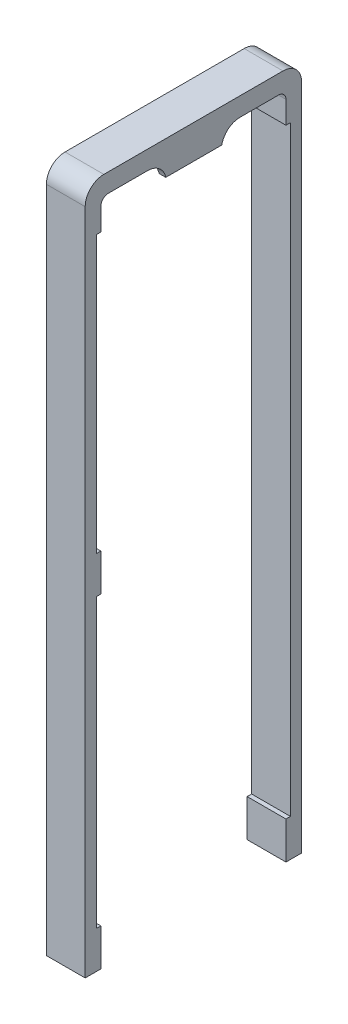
ISO-10303-21;
HEADER;
FILE_DESCRIPTION(('STEP AP214'),'2;1');
FILE_NAME('part.step','',(''),(''),'','','');
FILE_SCHEMA(('AUTOMOTIVE_DESIGN { 1 0 10303 214 1 1 1 1 }'));
ENDSEC;
DATA;
#1=APPLICATION_CONTEXT('core data for automotive mechanical design processes');
#2=APPLICATION_PROTOCOL_DEFINITION('international standard','automotive_design',2000,#1);
#3=PRODUCT_CONTEXT('',#1,'mechanical');
#4=PRODUCT('Part','Part','',(#3));
#5=PRODUCT_RELATED_PRODUCT_CATEGORY('part','',(#4));
#6=PRODUCT_DEFINITION_FORMATION('','',#4);
#7=PRODUCT_DEFINITION_CONTEXT('part definition',#1,'design');
#8=PRODUCT_DEFINITION('design','',#6,#7);
#9=PRODUCT_DEFINITION_SHAPE('','',#8);
#10=(LENGTH_UNIT() NAMED_UNIT(*) SI_UNIT(.MILLI.,.METRE.));
#11=(NAMED_UNIT(*) PLANE_ANGLE_UNIT() SI_UNIT($,.RADIAN.));
#12=(NAMED_UNIT(*) SI_UNIT($,.STERADIAN.) SOLID_ANGLE_UNIT());
#13=UNCERTAINTY_MEASURE_WITH_UNIT(LENGTH_MEASURE(1.E-05),#10,'distance_accuracy_value','');
#14=(GEOMETRIC_REPRESENTATION_CONTEXT(3) GLOBAL_UNCERTAINTY_ASSIGNED_CONTEXT((#13)) GLOBAL_UNIT_ASSIGNED_CONTEXT((#10,
#11,#12)) REPRESENTATION_CONTEXT('',''));
#15=CARTESIAN_POINT('',(0.,0.,0.));
#16=DIRECTION('',(0.,0.,1.));
#17=DIRECTION('',(1.,0.,0.));
#18=AXIS2_PLACEMENT_3D('',#15,#16,#17);
#19=CARTESIAN_POINT('',(0.,0.,4.2));
#20=DIRECTION('',(0.,0.,1.));
#21=DIRECTION('',(1.,0.,0.));
#22=AXIS2_PLACEMENT_3D('',#19,#20,#21);
#23=PLANE('',#22);
#24=DIRECTION('',(1.,0.,0.));
#25=VECTOR('',#24,1.);
#26=CARTESIAN_POINT('',(0.,-92.2973780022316,4.2));
#27=LINE('',#26,#25);
#28=CARTESIAN_POINT('',(-39.6440788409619,-92.2973780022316,4.20000000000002));
#29=VERTEX_POINT('',#28);
#30=CARTESIAN_POINT('',(-29.2440788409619,-92.2973780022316,4.20000000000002));
#31=VERTEX_POINT('',#30);
#32=EDGE_CURVE('E262',#29,#31,#27,.T.);
#33=ORIENTED_EDGE('',*,*,#32,.F.);
#34=DIRECTION('',(0.,-1.,0.));
#35=VECTOR('',#34,1.);
#36=CARTESIAN_POINT('',(-39.6440788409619,81.7026219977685,4.2));
#37=LINE('',#36,#35);
#38=CARTESIAN_POINT('',(-39.6440788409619,-102.297378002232,4.2));
#39=VERTEX_POINT('',#38);
#40=EDGE_CURVE('E281',#29,#39,#37,.T.);
#41=ORIENTED_EDGE('',*,*,#40,.T.);
#42=DIRECTION('',(1.,0.,0.));
#43=VECTOR('',#42,1.);
#44=CARTESIAN_POINT('',(-39.6440788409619,-102.297378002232,4.2));
#45=LINE('',#44,#43);
#46=CARTESIAN_POINT('',(-29.2440788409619,-102.297378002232,4.2));
#47=VERTEX_POINT('',#46);
#48=EDGE_CURVE('E280',#39,#47,#45,.T.);
#49=ORIENTED_EDGE('',*,*,#48,.T.);
#50=DIRECTION('',(0.,1.,0.));
#51=VECTOR('',#50,1.);
#52=CARTESIAN_POINT('',(-29.2440788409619,81.7026219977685,4.2));
#53=LINE('',#52,#51);
#54=EDGE_CURVE('E290',#47,#31,#53,.T.);
#55=ORIENTED_EDGE('',*,*,#54,.T.);
#56=EDGE_LOOP('',(#33,#41,#49,#55));
#57=FACE_BOUND('',#56,.T.);
#58=ADVANCED_FACE('F33',(#57),#23,.T.);
#59=CARTESIAN_POINT('',(0.,0.,53.8));
#60=DIRECTION('',(0.,0.,1.));
#61=DIRECTION('',(1.,0.,0.));
#62=AXIS2_PLACEMENT_3D('',#59,#60,#61);
#63=PLANE('',#62);
#64=DIRECTION('',(0.,1.,0.));
#65=VECTOR('',#64,1.);
#66=CARTESIAN_POINT('',(-29.2440788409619,81.7026219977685,53.8));
#67=LINE('',#66,#65);
#68=CARTESIAN_POINT('',(-29.2440788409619,-15.2973780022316,53.8));
#69=VERTEX_POINT('',#68);
#70=CARTESIAN_POINT('',(-29.2440788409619,-5.29737800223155,53.8));
#71=VERTEX_POINT('',#70);
#72=EDGE_CURVE('E523',#69,#71,#67,.T.);
#73=ORIENTED_EDGE('',*,*,#72,.F.);
#74=DIRECTION('',(-1.,0.,0.));
#75=VECTOR('',#74,1.);
#76=CARTESIAN_POINT('',(0.,-15.2973780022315,53.8));
#77=LINE('',#76,#75);
#78=CARTESIAN_POINT('',(-39.6440788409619,-15.2973780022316,53.8));
#79=VERTEX_POINT('',#78);
#80=EDGE_CURVE('E263',#69,#79,#77,.T.);
#81=ORIENTED_EDGE('',*,*,#80,.T.);
#82=DIRECTION('',(0.,-1.,0.));
#83=VECTOR('',#82,1.);
#84=CARTESIAN_POINT('',(-39.6440788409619,81.7026219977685,53.8));
#85=LINE('',#84,#83);
#86=CARTESIAN_POINT('',(-39.6440788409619,-5.29737800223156,53.8));
#87=VERTEX_POINT('',#86);
#88=EDGE_CURVE('E519',#87,#79,#85,.T.);
#89=ORIENTED_EDGE('',*,*,#88,.F.);
#90=DIRECTION('',(1.,0.,0.));
#91=VECTOR('',#90,1.);
#92=CARTESIAN_POINT('',(0.,-5.29737800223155,53.8));
#93=LINE('',#92,#91);
#94=EDGE_CURVE('E422',#87,#71,#93,.T.);
#95=ORIENTED_EDGE('',*,*,#94,.T.);
#96=EDGE_LOOP('',(#73,#81,#89,#95));
#97=FACE_BOUND('',#96,.T.);
#98=ADVANCED_FACE('F592',(#97),#63,.F.);
#99=CARTESIAN_POINT('',(-29.2440788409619,68.7026219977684,53.8));
#100=VERTEX_POINT('',#99);
#101=CARTESIAN_POINT('',(-29.2440788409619,74.7026219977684,53.8));
#102=VERTEX_POINT('',#101);
#103=EDGE_CURVE('E521',#100,#102,#67,.T.);
#104=ORIENTED_EDGE('',*,*,#103,.F.);
#105=DIRECTION('',(-1.,0.,0.));
#106=VECTOR('',#105,1.);
#107=CARTESIAN_POINT('',(0.,68.7026219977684,53.8));
#108=LINE('',#107,#106);
#109=CARTESIAN_POINT('',(-39.6440788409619,68.7026219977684,53.8));
#110=VERTEX_POINT('',#109);
#111=EDGE_CURVE('E425',#100,#110,#108,.T.);
#112=ORIENTED_EDGE('',*,*,#111,.T.);
#113=CARTESIAN_POINT('',(-39.6440788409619,74.7026219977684,53.8));
#114=VERTEX_POINT('',#113);
#115=EDGE_CURVE('E515',#114,#110,#85,.T.);
#116=ORIENTED_EDGE('',*,*,#115,.F.);
#117=DIRECTION('',(1.,0.,0.));
#118=VECTOR('',#117,1.);
#119=CARTESIAN_POINT('',(-29.2440788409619,74.7026219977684,53.8));
#120=LINE('',#119,#118);
#121=EDGE_CURVE('E315',#114,#102,#120,.T.);
#122=ORIENTED_EDGE('',*,*,#121,.T.);
#123=EDGE_LOOP('',(#104,#112,#116,#122));
#124=FACE_BOUND('',#123,.T.);
#125=ADVANCED_FACE('F585',(#124),#63,.F.);
#126=CARTESIAN_POINT('',(0.,74.7026219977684,0.));
#127=DIRECTION('',(0.,1.,0.));
#128=DIRECTION('',(0.,0.,1.));
#129=AXIS2_PLACEMENT_3D('',#126,#127,#128);
#130=PLANE('',#129);
#131=DIRECTION('',(-1.,0.,0.));
#132=VECTOR('',#131,1.);
#133=CARTESIAN_POINT('',(-31.0440788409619,74.7026219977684,37.2989794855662));
#134=LINE('',#133,#132);
#135=CARTESIAN_POINT('',(-31.2440788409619,74.7026219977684,37.2989794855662));
#136=VERTEX_POINT('',#135);
#137=CARTESIAN_POINT('',(-37.6440788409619,74.7026219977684,37.2989794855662));
#138=VERTEX_POINT('',#137);
#139=EDGE_CURVE('E348',#136,#138,#134,.T.);
#140=ORIENTED_EDGE('',*,*,#139,.T.);
#141=DIRECTION('',(0.,0.,1.));
#142=VECTOR('',#141,1.);
#143=CARTESIAN_POINT('',(-37.6440788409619,74.7026219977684,20.5010205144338));
#144=LINE('',#143,#142);
#145=CARTESIAN_POINT('',(-37.6440788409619,74.7026219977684,20.5010205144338));
#146=VERTEX_POINT('',#145);
#147=EDGE_CURVE('E362',#138,#146,#144,.F.);
#148=ORIENTED_EDGE('',*,*,#147,.T.);
#149=DIRECTION('',(-1.,0.,0.));
#150=VECTOR('',#149,1.);
#151=CARTESIAN_POINT('',(-37.8440788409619,74.7026219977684,20.5010205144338));
#152=LINE('',#151,#150);
#153=CARTESIAN_POINT('',(-31.2440788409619,74.7026219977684,20.5010205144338));
#154=VERTEX_POINT('',#153);
#155=EDGE_CURVE('E336',#146,#154,#152,.F.);
#156=ORIENTED_EDGE('',*,*,#155,.T.);
#157=DIRECTION('',(0.,0.,-1.));
#158=VECTOR('',#157,1.);
#159=CARTESIAN_POINT('',(-31.2440788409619,74.7026219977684,37.2989794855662));
#160=LINE('',#159,#158);
#161=EDGE_CURVE('E360',#154,#136,#160,.F.);
#162=ORIENTED_EDGE('',*,*,#161,.T.);
#163=EDGE_LOOP('',(#140,#148,#156,#162));
#164=FACE_BOUND('',#163,.T.);
#165=ADVANCED_FACE('F583',(#164),#130,.F.);
#166=CARTESIAN_POINT('',(-39.6440788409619,76.7026219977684,53.8));
#167=DIRECTION('',(0.,1.,0.));
#168=DIRECTION('',(0.,0.,1.));
#169=AXIS2_PLACEMENT_3D('',#166,#167,#168);
#170=PLANE('',#169);
#171=DIRECTION('',(0.,0.,-1.));
#172=VECTOR('',#171,1.);
#173=CARTESIAN_POINT('',(-29.2440788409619,76.7026219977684,53.8));
#174=LINE('',#173,#172);
#175=CARTESIAN_POINT('',(-29.2440788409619,76.7026219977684,16.5010205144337));
#176=VERTEX_POINT('',#175);
#177=CARTESIAN_POINT('',(-29.2440788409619,76.7026219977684,6.20000000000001));
#178=VERTEX_POINT('',#177);
#179=EDGE_CURVE('E528',#176,#178,#174,.T.);
#180=ORIENTED_EDGE('',*,*,#179,.F.);
#181=DIRECTION('',(-1.,0.,0.));
#182=VECTOR('',#181,1.);
#183=CARTESIAN_POINT('',(-39.6440788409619,76.7026219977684,16.5010205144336));
#184=LINE('',#183,#182);
#185=CARTESIAN_POINT('',(-39.6440788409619,76.7026219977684,16.5010205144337));
#186=VERTEX_POINT('',#185);
#187=EDGE_CURVE('E329',#176,#186,#184,.T.);
#188=ORIENTED_EDGE('',*,*,#187,.T.);
#189=DIRECTION('',(0.,0.,-1.));
#190=VECTOR('',#189,1.);
#191=CARTESIAN_POINT('',(-39.6440788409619,76.7026219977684,53.8));
#192=LINE('',#191,#190);
#193=CARTESIAN_POINT('',(-39.6440788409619,76.7026219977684,6.20000000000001));
#194=VERTEX_POINT('',#193);
#195=EDGE_CURVE('E531',#186,#194,#192,.T.);
#196=ORIENTED_EDGE('',*,*,#195,.T.);
#197=DIRECTION('',(1.,0.,0.));
#198=VECTOR('',#197,1.);
#199=CARTESIAN_POINT('',(-39.6440788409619,76.7026219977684,6.2));
#200=LINE('',#199,#198);
#201=EDGE_CURVE('E311',#194,#178,#200,.T.);
#202=ORIENTED_EDGE('',*,*,#201,.T.);
#203=EDGE_LOOP('',(#180,#188,#196,#202));
#204=FACE_BOUND('',#203,.T.);
#205=ADVANCED_FACE('F543',(#204),#170,.F.);
#206=CARTESIAN_POINT('',(-39.6440788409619,76.7026219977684,51.8));
#207=VERTEX_POINT('',#206);
#208=CARTESIAN_POINT('',(-39.6440788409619,76.7026219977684,41.2989794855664));
#209=VERTEX_POINT('',#208);
#210=EDGE_CURVE('E287',#207,#209,#192,.T.);
#211=ORIENTED_EDGE('',*,*,#210,.T.);
#212=DIRECTION('',(-1.,0.,0.));
#213=VECTOR('',#212,1.);
#214=CARTESIAN_POINT('',(-39.6440788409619,76.7026219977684,41.2989794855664));
#215=LINE('',#214,#213);
#216=CARTESIAN_POINT('',(-29.2440788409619,76.7026219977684,41.2989794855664));
#217=VERTEX_POINT('',#216);
#218=EDGE_CURVE('E331',#209,#217,#215,.F.);
#219=ORIENTED_EDGE('',*,*,#218,.T.);
#220=CARTESIAN_POINT('',(-29.2440788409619,76.7026219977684,51.8));
#221=VERTEX_POINT('',#220);
#222=EDGE_CURVE('E529',#221,#217,#174,.T.);
#223=ORIENTED_EDGE('',*,*,#222,.F.);
#224=DIRECTION('',(1.,0.,0.));
#225=VECTOR('',#224,1.);
#226=CARTESIAN_POINT('',(-39.6440788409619,76.7026219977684,51.8));
#227=LINE('',#226,#225);
#228=EDGE_CURVE('E318',#221,#207,#227,.F.);
#229=ORIENTED_EDGE('',*,*,#228,.T.);
#230=EDGE_LOOP('',(#211,#219,#223,#229));
#231=FACE_BOUND('',#230,.T.);
#232=ADVANCED_FACE('F566',(#231),#170,.F.);
#233=CARTESIAN_POINT('',(-39.6440788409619,81.7026219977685,4.2));
#234=DIRECTION('',(1.,0.,0.));
#235=DIRECTION('',(0.,1.,0.));
#236=AXIS2_PLACEMENT_3D('',#233,#234,#235);
#237=PLANE('',#236);
#238=ORIENTED_EDGE('',*,*,#40,.F.);
#239=DIRECTION('',(0.,0.,1.));
#240=VECTOR('',#239,1.);
#241=CARTESIAN_POINT('',(-39.6440788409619,-92.2973780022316,4.20000000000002));
#242=LINE('',#241,#240);
#243=CARTESIAN_POINT('',(-39.6440788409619,-92.2973780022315,3.00000000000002));
#244=VERTEX_POINT('',#243);
#245=EDGE_CURVE('E931',#244,#29,#242,.T.);
#246=ORIENTED_EDGE('',*,*,#245,.F.);
#247=DIRECTION('',(0.,-1.,0.));
#248=VECTOR('',#247,1.);
#249=CARTESIAN_POINT('',(-39.6440788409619,68.7026219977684,3.));
#250=LINE('',#249,#248);
#251=CARTESIAN_POINT('',(-39.6440788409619,68.7026219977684,3.));
#252=VERTEX_POINT('',#251);
#253=EDGE_CURVE('E274',#252,#244,#250,.T.);
#254=ORIENTED_EDGE('',*,*,#253,.F.);
#255=DIRECTION('',(0.,0.,-1.));
#256=VECTOR('',#255,1.);
#257=CARTESIAN_POINT('',(-39.6440788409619,68.7026219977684,4.2));
#258=LINE('',#257,#256);
#259=CARTESIAN_POINT('',(-39.6440788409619,68.7026219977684,4.2));
#260=VERTEX_POINT('',#259);
#261=EDGE_CURVE('E257',#260,#252,#258,.T.);
#262=ORIENTED_EDGE('',*,*,#261,.F.);
#263=CARTESIAN_POINT('',(-39.6440788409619,74.7026219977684,4.2));
#264=VERTEX_POINT('',#263);
#265=EDGE_CURVE('E270',#264,#260,#37,.T.);
#266=ORIENTED_EDGE('',*,*,#265,.F.);
#267=CARTESIAN_POINT('',(-39.6440788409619,74.7026219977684,6.2));
#268=DIRECTION('',(1.,0.,0.));
#269=DIRECTION('',(0.,1.,0.));
#270=AXIS2_PLACEMENT_3D('',#267,#268,#269);
#271=CIRCLE('',#270,2.);
#272=EDGE_CURVE('E323',#264,#194,#271,.T.);
#273=ORIENTED_EDGE('',*,*,#272,.T.);
#274=ORIENTED_EDGE('',*,*,#195,.F.);
#275=CARTESIAN_POINT('',(-39.6440788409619,71.7026219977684,16.5010205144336));
#276=DIRECTION('',(1.,0.,0.));
#277=DIRECTION('',(0.,1.,0.));
#278=AXIS2_PLACEMENT_3D('',#275,#276,#277);
#279=CIRCLE('',#278,5.);
#280=CARTESIAN_POINT('',(-39.6440788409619,72.7026219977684,21.4));
#281=VERTEX_POINT('',#280);
#282=EDGE_CURVE('E343',#186,#281,#279,.T.);
#283=ORIENTED_EDGE('',*,*,#282,.T.);
#284=DIRECTION('',(0.,0.,-1.));
#285=VECTOR('',#284,1.);
#286=CARTESIAN_POINT('',(-39.6440788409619,72.7026219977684,21.4));
#287=LINE('',#286,#285);
#288=CARTESIAN_POINT('',(-39.6440788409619,72.7026219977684,36.4));
#289=VERTEX_POINT('',#288);
#290=EDGE_CURVE('E494',#289,#281,#287,.T.);
#291=ORIENTED_EDGE('',*,*,#290,.F.);
#292=CARTESIAN_POINT('',(-39.6440788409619,71.7026219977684,41.2989794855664));
#293=DIRECTION('',(1.,0.,0.));
#294=DIRECTION('',(0.,1.,0.));
#295=AXIS2_PLACEMENT_3D('',#292,#293,#294);
#296=CIRCLE('',#295,5.);
#297=EDGE_CURVE('E353',#289,#209,#296,.T.);
#298=ORIENTED_EDGE('',*,*,#297,.T.);
#299=ORIENTED_EDGE('',*,*,#210,.F.);
#300=CARTESIAN_POINT('',(-39.6440788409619,74.7026219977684,51.8));
#301=DIRECTION('',(1.,0.,0.));
#302=DIRECTION('',(0.,1.,0.));
#303=AXIS2_PLACEMENT_3D('',#300,#301,#302);
#304=CIRCLE('',#303,2.);
#305=EDGE_CURVE('E327',#207,#114,#304,.T.);
#306=ORIENTED_EDGE('',*,*,#305,.T.);
#307=ORIENTED_EDGE('',*,*,#115,.T.);
#308=DIRECTION('',(0.,0.,-1.));
#309=VECTOR('',#308,1.);
#310=CARTESIAN_POINT('',(-39.6440788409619,68.7026219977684,53.8));
#311=LINE('',#310,#309);
#312=CARTESIAN_POINT('',(-39.6440788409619,68.7026219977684,55.));
#313=VERTEX_POINT('',#312);
#314=EDGE_CURVE('E471',#313,#110,#311,.T.);
#315=ORIENTED_EDGE('',*,*,#314,.F.);
#316=DIRECTION('',(0.,1.,0.));
#317=VECTOR('',#316,1.);
#318=CARTESIAN_POINT('',(-39.6440788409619,68.7026219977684,55.));
#319=LINE('',#318,#317);
#320=CARTESIAN_POINT('',(-39.6440788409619,-5.29737800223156,55.));
#321=VERTEX_POINT('',#320);
#322=EDGE_CURVE('E468',#321,#313,#319,.T.);
#323=ORIENTED_EDGE('',*,*,#322,.F.);
#324=DIRECTION('',(0.,0.,1.));
#325=VECTOR('',#324,1.);
#326=CARTESIAN_POINT('',(-39.6440788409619,-5.29737800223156,53.8));
#327=LINE('',#326,#325);
#328=EDGE_CURVE('E465',#87,#321,#327,.T.);
#329=ORIENTED_EDGE('',*,*,#328,.F.);
#330=ORIENTED_EDGE('',*,*,#88,.T.);
#331=DIRECTION('',(0.,0.,-1.));
#332=VECTOR('',#331,1.);
#333=CARTESIAN_POINT('',(-39.6440788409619,-15.2973780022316,53.8));
#334=LINE('',#333,#332);
#335=CARTESIAN_POINT('',(-39.6440788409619,-15.2973780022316,55.));
#336=VERTEX_POINT('',#335);
#337=EDGE_CURVE('E452',#336,#79,#334,.T.);
#338=ORIENTED_EDGE('',*,*,#337,.F.);
#339=DIRECTION('',(0.,1.,0.));
#340=VECTOR('',#339,1.);
#341=CARTESIAN_POINT('',(-39.6440788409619,-15.2973780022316,55.));
#342=LINE('',#341,#340);
#343=CARTESIAN_POINT('',(-39.6440788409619,-92.2973780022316,55.));
#344=VERTEX_POINT('',#343);
#345=EDGE_CURVE('E455',#344,#336,#342,.T.);
#346=ORIENTED_EDGE('',*,*,#345,.F.);
#347=DIRECTION('',(0.,0.,1.));
#348=VECTOR('',#347,1.);
#349=CARTESIAN_POINT('',(-39.6440788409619,-92.2973780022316,53.8));
#350=LINE('',#349,#348);
#351=CARTESIAN_POINT('',(-39.6440788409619,-92.2973780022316,53.8));
#352=VERTEX_POINT('',#351);
#353=EDGE_CURVE('E450',#352,#344,#350,.T.);
#354=ORIENTED_EDGE('',*,*,#353,.F.);
#355=CARTESIAN_POINT('',(-39.6440788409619,-102.297378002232,53.8));
#356=VERTEX_POINT('',#355);
#357=EDGE_CURVE('E505',#352,#356,#85,.T.);
#358=ORIENTED_EDGE('',*,*,#357,.T.);
#359=DIRECTION('',(0.,0.,-1.));
#360=VECTOR('',#359,1.);
#361=CARTESIAN_POINT('',(-39.6440788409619,-102.297378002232,58.));
#362=LINE('',#361,#360);
#363=CARTESIAN_POINT('',(-39.6440788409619,-102.297378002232,58.));
#364=VERTEX_POINT('',#363);
#365=EDGE_CURVE('E526',#364,#356,#362,.T.);
#366=ORIENTED_EDGE('',*,*,#365,.F.);
#367=DIRECTION('',(0.,-1.,0.));
#368=VECTOR('',#367,1.);
#369=CARTESIAN_POINT('',(-39.6440788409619,81.7026219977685,58.));
#370=LINE('',#369,#368);
#371=CARTESIAN_POINT('',(-39.6440788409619,76.7026219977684,58.));
#372=VERTEX_POINT('',#371);
#373=EDGE_CURVE('E506',#372,#364,#370,.T.);
#374=ORIENTED_EDGE('',*,*,#373,.F.);
#375=CARTESIAN_POINT('',(-39.6440788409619,76.7026219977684,53.));
#376=DIRECTION('',(1.,0.,0.));
#377=DIRECTION('',(0.,1.,0.));
#378=AXIS2_PLACEMENT_3D('',#375,#376,#377);
#379=CIRCLE('',#378,5.);
#380=CARTESIAN_POINT('',(-39.6440788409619,81.7026219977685,53.));
#381=VERTEX_POINT('',#380);
#382=EDGE_CURVE('E409',#372,#381,#379,.F.);
#383=ORIENTED_EDGE('',*,*,#382,.T.);
#384=DIRECTION('',(0.,0.,-1.));
#385=VECTOR('',#384,1.);
#386=CARTESIAN_POINT('',(-39.6440788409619,81.7026219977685,4.2));
#387=LINE('',#386,#385);
#388=CARTESIAN_POINT('',(-39.6440788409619,81.7026219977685,5.));
#389=VERTEX_POINT('',#388);
#390=EDGE_CURVE('E293',#381,#389,#387,.T.);
#391=ORIENTED_EDGE('',*,*,#390,.T.);
#392=CARTESIAN_POINT('',(-39.6440788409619,76.7026219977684,5.));
#393=DIRECTION('',(1.,0.,0.));
#394=DIRECTION('',(0.,1.,0.));
#395=AXIS2_PLACEMENT_3D('',#392,#393,#394);
#396=CIRCLE('',#395,5.);
#397=CARTESIAN_POINT('',(-39.6440788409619,76.7026219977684,0.));
#398=VERTEX_POINT('',#397);
#399=EDGE_CURVE('E411',#389,#398,#396,.F.);
#400=ORIENTED_EDGE('',*,*,#399,.T.);
#401=DIRECTION('',(0.,-1.,0.));
#402=VECTOR('',#401,1.);
#403=CARTESIAN_POINT('',(-39.6440788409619,81.7026219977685,0.));
#404=LINE('',#403,#402);
#405=CARTESIAN_POINT('',(-39.6440788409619,-102.297378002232,0.));
#406=VERTEX_POINT('',#405);
#407=EDGE_CURVE('E294',#398,#406,#404,.T.);
#408=ORIENTED_EDGE('',*,*,#407,.T.);
#409=DIRECTION('',(0.,0.,-1.));
#410=VECTOR('',#409,1.);
#411=CARTESIAN_POINT('',(-39.6440788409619,-102.297378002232,4.2));
#412=LINE('',#411,#410);
#413=EDGE_CURVE('E308',#39,#406,#412,.T.);
#414=ORIENTED_EDGE('',*,*,#413,.F.);
#415=EDGE_LOOP('',(#238,#246,#254,#262,#266,#273,#274,#283,#291,#298,#299,#306,#307,#315,#323,
#329,#330,#338,#346,#354,#358,#366,#374,#383,#391,#400,#408,#414));
#416=FACE_BOUND('',#415,.T.);
#417=ADVANCED_FACE('F268',(#416),#237,.F.);
#418=CARTESIAN_POINT('',(-39.6440788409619,-102.297378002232,4.2));
#419=DIRECTION('',(0.,1.,0.));
#420=DIRECTION('',(0.,0.,1.));
#421=AXIS2_PLACEMENT_3D('',#418,#419,#420);
#422=PLANE('',#421);
#423=DIRECTION('',(1.,0.,0.));
#424=VECTOR('',#423,1.);
#425=CARTESIAN_POINT('',(-39.6440788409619,-102.297378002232,0.));
#426=LINE('',#425,#424);
#427=CARTESIAN_POINT('',(-29.2440788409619,-102.297378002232,0.));
#428=VERTEX_POINT('',#427);
#429=EDGE_CURVE('E296',#406,#428,#426,.T.);
#430=ORIENTED_EDGE('',*,*,#429,.T.);
#431=DIRECTION('',(0.,0.,-1.));
#432=VECTOR('',#431,1.);
#433=CARTESIAN_POINT('',(-29.2440788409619,-102.297378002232,4.2));
#434=LINE('',#433,#432);
#435=EDGE_CURVE('E305',#47,#428,#434,.T.);
#436=ORIENTED_EDGE('',*,*,#435,.F.);
#437=ORIENTED_EDGE('',*,*,#48,.F.);
#438=ORIENTED_EDGE('',*,*,#413,.T.);
#439=EDGE_LOOP('',(#430,#436,#437,#438));
#440=FACE_BOUND('',#439,.T.);
#441=ADVANCED_FACE('F620',(#440),#422,.F.);
#442=CARTESIAN_POINT('',(-29.2440788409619,81.7026219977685,4.2));
#443=DIRECTION('',(-1.,0.,0.));
#444=DIRECTION('',(0.,-1.,0.));
#445=AXIS2_PLACEMENT_3D('',#442,#443,#444);
#446=PLANE('',#445);
#447=DIRECTION('',(0.,-1.,0.));
#448=VECTOR('',#447,1.);
#449=CARTESIAN_POINT('',(-29.2440788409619,81.7026219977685,3.));
#450=LINE('',#449,#448);
#451=CARTESIAN_POINT('',(-29.2440788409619,68.7026219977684,3.));
#452=VERTEX_POINT('',#451);
#453=CARTESIAN_POINT('',(-29.2440788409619,-92.2973780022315,3.00000000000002));
#454=VERTEX_POINT('',#453);
#455=EDGE_CURVE('E11',#452,#454,#450,.T.);
#456=ORIENTED_EDGE('',*,*,#455,.T.);
#457=DIRECTION('',(0.,0.,1.));
#458=VECTOR('',#457,1.);
#459=CARTESIAN_POINT('',(-29.2440788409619,-92.2973780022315,4.19999999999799));
#460=LINE('',#459,#458);
#461=EDGE_CURVE('E462',#454,#31,#460,.T.);
#462=ORIENTED_EDGE('',*,*,#461,.T.);
#463=ORIENTED_EDGE('',*,*,#54,.F.);
#464=ORIENTED_EDGE('',*,*,#435,.T.);
#465=DIRECTION('',(0.,1.,0.));
#466=VECTOR('',#465,1.);
#467=CARTESIAN_POINT('',(-29.2440788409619,81.7026219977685,0.));
#468=LINE('',#467,#466);
#469=CARTESIAN_POINT('',(-29.2440788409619,76.7026219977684,0.));
#470=VERTEX_POINT('',#469);
#471=EDGE_CURVE('E285',#428,#470,#468,.T.);
#472=ORIENTED_EDGE('',*,*,#471,.T.);
#473=CARTESIAN_POINT('',(-29.2440788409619,76.7026219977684,5.));
#474=DIRECTION('',(-1.,0.,0.));
#475=DIRECTION('',(0.,-1.,0.));
#476=AXIS2_PLACEMENT_3D('',#473,#474,#475);
#477=CIRCLE('',#476,5.);
#478=CARTESIAN_POINT('',(-29.2440788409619,81.7026219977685,5.));
#479=VERTEX_POINT('',#478);
#480=EDGE_CURVE('E417',#470,#479,#477,.F.);
#481=ORIENTED_EDGE('',*,*,#480,.T.);
#482=DIRECTION('',(0.,0.,-1.));
#483=VECTOR('',#482,1.);
#484=CARTESIAN_POINT('',(-29.2440788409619,81.7026219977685,4.2));
#485=LINE('',#484,#483);
#486=CARTESIAN_POINT('',(-29.2440788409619,81.7026219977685,53.));
#487=VERTEX_POINT('',#486);
#488=EDGE_CURVE('E302',#487,#479,#485,.T.);
#489=ORIENTED_EDGE('',*,*,#488,.F.);
#490=CARTESIAN_POINT('',(-29.2440788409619,76.7026219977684,53.));
#491=DIRECTION('',(-1.,0.,0.));
#492=DIRECTION('',(0.,-1.,0.));
#493=AXIS2_PLACEMENT_3D('',#490,#491,#492);
#494=CIRCLE('',#493,5.);
#495=CARTESIAN_POINT('',(-29.2440788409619,76.7026219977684,58.));
#496=VERTEX_POINT('',#495);
#497=EDGE_CURVE('E415',#487,#496,#494,.F.);
#498=ORIENTED_EDGE('',*,*,#497,.T.);
#499=DIRECTION('',(0.,1.,0.));
#500=VECTOR('',#499,1.);
#501=CARTESIAN_POINT('',(-29.2440788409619,81.7026219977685,58.));
#502=LINE('',#501,#500);
#503=CARTESIAN_POINT('',(-29.2440788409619,-102.297378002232,58.));
#504=VERTEX_POINT('',#503);
#505=EDGE_CURVE('E511',#504,#496,#502,.T.);
#506=ORIENTED_EDGE('',*,*,#505,.F.);
#507=DIRECTION('',(0.,0.,-1.));
#508=VECTOR('',#507,1.);
#509=CARTESIAN_POINT('',(-29.2440788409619,-102.297378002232,58.));
#510=LINE('',#509,#508);
#511=CARTESIAN_POINT('',(-29.2440788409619,-102.297378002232,53.8));
#512=VERTEX_POINT('',#511);
#513=EDGE_CURVE('E514',#504,#512,#510,.T.);
#514=ORIENTED_EDGE('',*,*,#513,.T.);
#515=CARTESIAN_POINT('',(-29.2440788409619,-92.2973780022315,53.8));
#516=VERTEX_POINT('',#515);
#517=EDGE_CURVE('E509',#512,#516,#67,.T.);
#518=ORIENTED_EDGE('',*,*,#517,.T.);
#519=DIRECTION('',(0.,0.,1.));
#520=VECTOR('',#519,1.);
#521=CARTESIAN_POINT('',(-29.2440788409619,-92.297378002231,4.19999999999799));
#522=LINE('',#521,#520);
#523=CARTESIAN_POINT('',(-29.2440788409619,-92.2973780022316,55.));
#524=VERTEX_POINT('',#523);
#525=EDGE_CURVE('E56',#516,#524,#522,.T.);
#526=ORIENTED_EDGE('',*,*,#525,.T.);
#527=DIRECTION('',(0.,1.,0.));
#528=VECTOR('',#527,1.);
#529=CARTESIAN_POINT('',(-29.2440788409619,81.7026219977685,55.));
#530=LINE('',#529,#528);
#531=CARTESIAN_POINT('',(-29.2440788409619,-15.2973780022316,55.));
#532=VERTEX_POINT('',#531);
#533=EDGE_CURVE('E41',#524,#532,#530,.T.);
#534=ORIENTED_EDGE('',*,*,#533,.T.);
#535=DIRECTION('',(0.,0.,-1.));
#536=VECTOR('',#535,1.);
#537=CARTESIAN_POINT('',(-29.2440788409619,-15.2973780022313,4.19999999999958));
#538=LINE('',#537,#536);
#539=EDGE_CURVE('E439',#532,#69,#538,.T.);
#540=ORIENTED_EDGE('',*,*,#539,.T.);
#541=ORIENTED_EDGE('',*,*,#72,.T.);
#542=DIRECTION('',(0.,0.,1.));
#543=VECTOR('',#542,1.);
#544=CARTESIAN_POINT('',(-29.2440788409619,-5.29737800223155,4.2));
#545=LINE('',#544,#543);
#546=CARTESIAN_POINT('',(-29.2440788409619,-5.29737800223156,55.));
#547=VERTEX_POINT('',#546);
#548=EDGE_CURVE('E476',#71,#547,#545,.T.);
#549=ORIENTED_EDGE('',*,*,#548,.T.);
#550=DIRECTION('',(0.,1.,0.));
#551=VECTOR('',#550,1.);
#552=CARTESIAN_POINT('',(-29.2440788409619,81.7026219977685,55.));
#553=LINE('',#552,#551);
#554=CARTESIAN_POINT('',(-29.2440788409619,68.7026219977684,55.));
#555=VERTEX_POINT('',#554);
#556=EDGE_CURVE('E428',#547,#555,#553,.T.);
#557=ORIENTED_EDGE('',*,*,#556,.T.);
#558=DIRECTION('',(0.,0.,-1.));
#559=VECTOR('',#558,1.);
#560=CARTESIAN_POINT('',(-29.2440788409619,68.7026219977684,4.2));
#561=LINE('',#560,#559);
#562=EDGE_CURVE('E480',#555,#100,#561,.T.);
#563=ORIENTED_EDGE('',*,*,#562,.T.);
#564=ORIENTED_EDGE('',*,*,#103,.T.);
#565=CARTESIAN_POINT('',(-29.2440788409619,74.7026219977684,51.8));
#566=DIRECTION('',(-1.,0.,0.));
#567=DIRECTION('',(0.,-1.,0.));
#568=AXIS2_PLACEMENT_3D('',#565,#566,#567);
#569=CIRCLE('',#568,2.);
#570=EDGE_CURVE('E325',#102,#221,#569,.T.);
#571=ORIENTED_EDGE('',*,*,#570,.T.);
#572=ORIENTED_EDGE('',*,*,#222,.T.);
#573=CARTESIAN_POINT('',(-29.2440788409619,71.7026219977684,41.2989794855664));
#574=DIRECTION('',(-1.,0.,0.));
#575=DIRECTION('',(0.,-1.,0.));
#576=AXIS2_PLACEMENT_3D('',#573,#574,#575);
#577=CIRCLE('',#576,5.);
#578=CARTESIAN_POINT('',(-29.2440788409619,72.7026219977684,36.4));
#579=VERTEX_POINT('',#578);
#580=EDGE_CURVE('E355',#217,#579,#577,.T.);
#581=ORIENTED_EDGE('',*,*,#580,.T.);
#582=DIRECTION('',(0.,0.,1.));
#583=VECTOR('',#582,1.);
#584=CARTESIAN_POINT('',(-29.2440788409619,72.7026219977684,21.4));
#585=LINE('',#584,#583);
#586=CARTESIAN_POINT('',(-29.2440788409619,72.7026219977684,21.4));
#587=VERTEX_POINT('',#586);
#588=EDGE_CURVE('E483',#587,#579,#585,.T.);
#589=ORIENTED_EDGE('',*,*,#588,.F.);
#590=CARTESIAN_POINT('',(-29.2440788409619,71.7026219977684,16.5010205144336));
#591=DIRECTION('',(-1.,0.,0.));
#592=DIRECTION('',(0.,-1.,0.));
#593=AXIS2_PLACEMENT_3D('',#590,#591,#592);
#594=CIRCLE('',#593,5.);
#595=EDGE_CURVE('E341',#587,#176,#594,.T.);
#596=ORIENTED_EDGE('',*,*,#595,.T.);
#597=ORIENTED_EDGE('',*,*,#179,.T.);
#598=CARTESIAN_POINT('',(-29.2440788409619,74.7026219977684,6.2));
#599=DIRECTION('',(-1.,0.,0.));
#600=DIRECTION('',(0.,-1.,0.));
#601=AXIS2_PLACEMENT_3D('',#598,#599,#600);
#602=CIRCLE('',#601,2.);
#603=CARTESIAN_POINT('',(-29.2440788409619,74.7026219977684,4.2));
#604=VERTEX_POINT('',#603);
#605=EDGE_CURVE('E320',#178,#604,#602,.T.);
#606=ORIENTED_EDGE('',*,*,#605,.T.);
#607=CARTESIAN_POINT('',(-29.2440788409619,68.7026219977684,4.2));
#608=VERTEX_POINT('',#607);
#609=EDGE_CURVE('E283',#608,#604,#53,.T.);
#610=ORIENTED_EDGE('',*,*,#609,.F.);
#611=DIRECTION('',(0.,0.,-1.));
#612=VECTOR('',#611,1.);
#613=CARTESIAN_POINT('',(-29.2440788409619,68.7026219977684,4.2));
#614=LINE('',#613,#612);
#615=EDGE_CURVE('E48',#608,#452,#614,.T.);
#616=ORIENTED_EDGE('',*,*,#615,.T.);
#617=EDGE_LOOP('',(#456,#462,#463,#464,#472,#481,#489,#498,#506,#514,#518,#526,#534,#540,#541,
#549,#557,#563,#564,#571,#572,#581,#589,#596,#597,#606,#610,#616));
#618=FACE_BOUND('',#617,.T.);
#619=ADVANCED_FACE('F438',(#618),#446,.F.);
#620=CARTESIAN_POINT('',(-39.6440788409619,81.7026219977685,4.2));
#621=DIRECTION('',(0.,-1.,0.));
#622=DIRECTION('',(0.,0.,-1.));
#623=AXIS2_PLACEMENT_3D('',#620,#621,#622);
#624=PLANE('',#623);
#625=ORIENTED_EDGE('',*,*,#488,.T.);
#626=DIRECTION('',(-1.,0.,0.));
#627=VECTOR('',#626,1.);
#628=CARTESIAN_POINT('',(-39.6440788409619,81.7026219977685,5.));
#629=LINE('',#628,#627);
#630=EDGE_CURVE('E406',#479,#389,#629,.T.);
#631=ORIENTED_EDGE('',*,*,#630,.T.);
#632=ORIENTED_EDGE('',*,*,#390,.F.);
#633=DIRECTION('',(-1.,0.,0.));
#634=VECTOR('',#633,1.);
#635=CARTESIAN_POINT('',(-29.2440788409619,81.7026219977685,53.));
#636=LINE('',#635,#634);
#637=EDGE_CURVE('E404',#381,#487,#636,.F.);
#638=ORIENTED_EDGE('',*,*,#637,.T.);
#639=EDGE_LOOP('',(#625,#631,#632,#638));
#640=FACE_BOUND('',#639,.T.);
#641=ADVANCED_FACE('F609',(#640),#624,.F.);
#642=DIRECTION('',(-1.,0.,0.));
#643=VECTOR('',#642,1.);
#644=CARTESIAN_POINT('',(0.,68.7026219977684,4.2));
#645=LINE('',#644,#643);
#646=EDGE_CURVE('E254',#608,#260,#645,.T.);
#647=ORIENTED_EDGE('',*,*,#646,.F.);
#648=ORIENTED_EDGE('',*,*,#609,.T.);
#649=DIRECTION('',(1.,0.,0.));
#650=VECTOR('',#649,1.);
#651=CARTESIAN_POINT('',(0.,74.7026219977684,4.2));
#652=LINE('',#651,#650);
#653=EDGE_CURVE('E279',#604,#264,#652,.F.);
#654=ORIENTED_EDGE('',*,*,#653,.T.);
#655=ORIENTED_EDGE('',*,*,#265,.T.);
#656=EDGE_LOOP('',(#647,#648,#654,#655));
#657=FACE_BOUND('',#656,.T.);
#658=ADVANCED_FACE('F277',(#657),#23,.T.);
#659=CARTESIAN_POINT('',(0.,0.,0.));
#660=DIRECTION('',(0.,0.,1.));
#661=DIRECTION('',(1.,0.,0.));
#662=AXIS2_PLACEMENT_3D('',#659,#660,#661);
#663=PLANE('',#662);
#664=ORIENTED_EDGE('',*,*,#407,.F.);
#665=DIRECTION('',(-1.,0.,0.));
#666=VECTOR('',#665,1.);
#667=CARTESIAN_POINT('',(0.,76.7026219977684,0.));
#668=LINE('',#667,#666);
#669=EDGE_CURVE('E413',#398,#470,#668,.F.);
#670=ORIENTED_EDGE('',*,*,#669,.T.);
#671=ORIENTED_EDGE('',*,*,#471,.F.);
#672=ORIENTED_EDGE('',*,*,#429,.F.);
#673=EDGE_LOOP('',(#664,#670,#671,#672));
#674=FACE_BOUND('',#673,.T.);
#675=ADVANCED_FACE('F608',(#674),#663,.F.);
#676=ORIENTED_EDGE('',*,*,#357,.F.);
#677=DIRECTION('',(1.,0.,0.));
#678=VECTOR('',#677,1.);
#679=CARTESIAN_POINT('',(0.,-92.2973780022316,53.8));
#680=LINE('',#679,#678);
#681=EDGE_CURVE('E431',#352,#516,#680,.T.);
#682=ORIENTED_EDGE('',*,*,#681,.T.);
#683=ORIENTED_EDGE('',*,*,#517,.F.);
#684=DIRECTION('',(1.,0.,0.));
#685=VECTOR('',#684,1.);
#686=CARTESIAN_POINT('',(-39.6440788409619,-102.297378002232,53.8));
#687=LINE('',#686,#685);
#688=EDGE_CURVE('E518',#356,#512,#687,.T.);
#689=ORIENTED_EDGE('',*,*,#688,.F.);
#690=EDGE_LOOP('',(#676,#682,#683,#689));
#691=FACE_BOUND('',#690,.T.);
#692=ADVANCED_FACE('F595',(#691),#63,.F.);
#693=CARTESIAN_POINT('',(-39.6440788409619,-102.297378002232,58.));
#694=DIRECTION('',(0.,1.,0.));
#695=DIRECTION('',(0.,0.,1.));
#696=AXIS2_PLACEMENT_3D('',#693,#694,#695);
#697=PLANE('',#696);
#698=ORIENTED_EDGE('',*,*,#688,.T.);
#699=ORIENTED_EDGE('',*,*,#513,.F.);
#700=DIRECTION('',(1.,0.,0.));
#701=VECTOR('',#700,1.);
#702=CARTESIAN_POINT('',(-39.6440788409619,-102.297378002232,58.));
#703=LINE('',#702,#701);
#704=EDGE_CURVE('E508',#364,#504,#703,.T.);
#705=ORIENTED_EDGE('',*,*,#704,.F.);
#706=ORIENTED_EDGE('',*,*,#365,.T.);
#707=EDGE_LOOP('',(#698,#699,#705,#706));
#708=FACE_BOUND('',#707,.T.);
#709=ADVANCED_FACE('F853',(#708),#697,.F.);
#710=CARTESIAN_POINT('',(0.,0.,58.));
#711=DIRECTION('',(0.,0.,1.));
#712=DIRECTION('',(1.,0.,0.));
#713=AXIS2_PLACEMENT_3D('',#710,#711,#712);
#714=PLANE('',#713);
#715=ORIENTED_EDGE('',*,*,#505,.T.);
#716=DIRECTION('',(-1.,0.,0.));
#717=VECTOR('',#716,1.);
#718=CARTESIAN_POINT('',(-39.6440788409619,76.7026219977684,58.));
#719=LINE('',#718,#717);
#720=EDGE_CURVE('E419',#496,#372,#719,.T.);
#721=ORIENTED_EDGE('',*,*,#720,.T.);
#722=ORIENTED_EDGE('',*,*,#373,.T.);
#723=ORIENTED_EDGE('',*,*,#704,.T.);
#724=EDGE_LOOP('',(#715,#721,#722,#723));
#725=FACE_BOUND('',#724,.T.);
#726=ADVANCED_FACE('F818',(#725),#714,.T.);
#727=CARTESIAN_POINT('',(-37.8440788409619,72.7026219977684,21.4));
#728=DIRECTION('',(-1.,0.,0.));
#729=DIRECTION('',(0.,0.,1.));
#730=AXIS2_PLACEMENT_3D('',#727,#728,#729);
#731=PLANE('',#730);
#732=CARTESIAN_POINT('',(-37.8440788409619,71.7026219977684,16.5010205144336));
#733=DIRECTION('',(-1.,0.,0.));
#734=DIRECTION('',(0.,0.,1.));
#735=AXIS2_PLACEMENT_3D('',#732,#733,#734);
#736=CIRCLE('',#735,5.);
#737=CARTESIAN_POINT('',(-37.8440788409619,72.7026219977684,21.4));
#738=VERTEX_POINT('',#737);
#739=CARTESIAN_POINT('',(-37.8440788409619,74.5026219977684,20.6434835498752));
#740=VERTEX_POINT('',#739);
#741=EDGE_CURVE('E333',#738,#740,#736,.T.);
#742=ORIENTED_EDGE('',*,*,#741,.T.);
#743=DIRECTION('',(0.,0.,1.));
#744=VECTOR('',#743,1.);
#745=CARTESIAN_POINT('',(-37.8440788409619,74.5026219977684,37.2989794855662));
#746=LINE('',#745,#744);
#747=CARTESIAN_POINT('',(-37.8440788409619,74.5026219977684,37.1565164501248));
#748=VERTEX_POINT('',#747);
#749=EDGE_CURVE('E357',#740,#748,#746,.T.);
#750=ORIENTED_EDGE('',*,*,#749,.T.);
#751=CARTESIAN_POINT('',(-37.8440788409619,71.7026219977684,41.2989794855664));
#752=DIRECTION('',(-1.,0.,0.));
#753=DIRECTION('',(0.,0.,1.));
#754=AXIS2_PLACEMENT_3D('',#751,#752,#753);
#755=CIRCLE('',#754,5.);
#756=CARTESIAN_POINT('',(-37.8440788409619,72.7026219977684,36.4));
#757=VERTEX_POINT('',#756);
#758=EDGE_CURVE('E351',#748,#757,#755,.T.);
#759=ORIENTED_EDGE('',*,*,#758,.T.);
#760=DIRECTION('',(0.,0.,1.));
#761=VECTOR('',#760,1.);
#762=CARTESIAN_POINT('',(-37.8440788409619,72.7026219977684,21.4));
#763=LINE('',#762,#761);
#764=EDGE_CURVE('E500',#738,#757,#763,.T.);
#765=ORIENTED_EDGE('',*,*,#764,.F.);
#766=EDGE_LOOP('',(#742,#750,#759,#765));
#767=FACE_BOUND('',#766,.T.);
#768=ADVANCED_FACE('F555',(#767),#731,.F.);
#769=CARTESIAN_POINT('',(0.,72.7026219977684,0.));
#770=DIRECTION('',(0.,1.,0.));
#771=DIRECTION('',(0.,0.,1.));
#772=AXIS2_PLACEMENT_3D('',#769,#770,#771);
#773=PLANE('',#772);
#774=ORIENTED_EDGE('',*,*,#290,.T.);
#775=DIRECTION('',(1.,0.,0.));
#776=VECTOR('',#775,1.);
#777=CARTESIAN_POINT('',(-39.6440788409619,72.7026219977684,21.4));
#778=LINE('',#777,#776);
#779=EDGE_CURVE('E497',#281,#738,#778,.T.);
#780=ORIENTED_EDGE('',*,*,#779,.T.);
#781=ORIENTED_EDGE('',*,*,#764,.T.);
#782=DIRECTION('',(-1.,0.,0.));
#783=VECTOR('',#782,1.);
#784=CARTESIAN_POINT('',(-39.6440788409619,72.7026219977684,36.4));
#785=LINE('',#784,#783);
#786=EDGE_CURVE('E503',#757,#289,#785,.T.);
#787=ORIENTED_EDGE('',*,*,#786,.T.);
#788=EDGE_LOOP('',(#774,#780,#781,#787));
#789=FACE_BOUND('',#788,.T.);
#790=ADVANCED_FACE('F552',(#789),#773,.F.);
#791=CARTESIAN_POINT('',(-31.0440788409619,72.7026219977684,21.4));
#792=DIRECTION('',(1.,0.,0.));
#793=DIRECTION('',(0.,0.,-1.));
#794=AXIS2_PLACEMENT_3D('',#791,#792,#793);
#795=PLANE('',#794);
#796=CARTESIAN_POINT('',(-31.0440788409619,71.7026219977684,41.2989794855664));
#797=DIRECTION('',(1.,0.,0.));
#798=DIRECTION('',(0.,0.,-1.));
#799=AXIS2_PLACEMENT_3D('',#796,#797,#798);
#800=CIRCLE('',#799,5.);
#801=CARTESIAN_POINT('',(-31.0440788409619,72.7026219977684,36.4));
#802=VERTEX_POINT('',#801);
#803=CARTESIAN_POINT('',(-31.0440788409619,74.5026219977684,37.1565164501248));
#804=VERTEX_POINT('',#803);
#805=EDGE_CURVE('E345',#802,#804,#800,.T.);
#806=ORIENTED_EDGE('',*,*,#805,.T.);
#807=DIRECTION('',(0.,0.,-1.));
#808=VECTOR('',#807,1.);
#809=CARTESIAN_POINT('',(-31.0440788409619,74.5026219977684,20.5010205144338));
#810=LINE('',#809,#808);
#811=CARTESIAN_POINT('',(-31.0440788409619,74.5026219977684,20.6434835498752));
#812=VERTEX_POINT('',#811);
#813=EDGE_CURVE('E364',#804,#812,#810,.T.);
#814=ORIENTED_EDGE('',*,*,#813,.T.);
#815=CARTESIAN_POINT('',(-31.0440788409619,71.7026219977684,16.5010205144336));
#816=DIRECTION('',(1.,0.,0.));
#817=DIRECTION('',(0.,0.,-1.));
#818=AXIS2_PLACEMENT_3D('',#815,#816,#817);
#819=CIRCLE('',#818,5.);
#820=CARTESIAN_POINT('',(-31.0440788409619,72.7026219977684,21.4));
#821=VERTEX_POINT('',#820);
#822=EDGE_CURVE('E339',#812,#821,#819,.T.);
#823=ORIENTED_EDGE('',*,*,#822,.T.);
#824=DIRECTION('',(0.,0.,-1.));
#825=VECTOR('',#824,1.);
#826=CARTESIAN_POINT('',(-31.0440788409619,72.7026219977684,21.4));
#827=LINE('',#826,#825);
#828=EDGE_CURVE('E489',#802,#821,#827,.T.);
#829=ORIENTED_EDGE('',*,*,#828,.F.);
#830=EDGE_LOOP('',(#806,#814,#823,#829));
#831=FACE_BOUND('',#830,.T.);
#832=ADVANCED_FACE('F576',(#831),#795,.F.);
#833=CARTESIAN_POINT('',(0.,72.7026219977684,0.));
#834=DIRECTION('',(0.,-1.,0.));
#835=DIRECTION('',(0.,0.,-1.));
#836=AXIS2_PLACEMENT_3D('',#833,#834,#835);
#837=PLANE('',#836);
#838=ORIENTED_EDGE('',*,*,#588,.T.);
#839=DIRECTION('',(-1.,0.,0.));
#840=VECTOR('',#839,1.);
#841=CARTESIAN_POINT('',(-29.2440788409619,72.7026219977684,36.4));
#842=LINE('',#841,#840);
#843=EDGE_CURVE('E486',#579,#802,#842,.T.);
#844=ORIENTED_EDGE('',*,*,#843,.T.);
#845=ORIENTED_EDGE('',*,*,#828,.T.);
#846=DIRECTION('',(1.,0.,0.));
#847=VECTOR('',#846,1.);
#848=CARTESIAN_POINT('',(-29.2440788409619,72.7026219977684,21.4));
#849=LINE('',#848,#847);
#850=EDGE_CURVE('E492',#821,#587,#849,.T.);
#851=ORIENTED_EDGE('',*,*,#850,.T.);
#852=EDGE_LOOP('',(#838,#844,#845,#851));
#853=FACE_BOUND('',#852,.T.);
#854=ADVANCED_FACE('F570',(#853),#837,.T.);
#855=CARTESIAN_POINT('',(-39.6440788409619,74.7026219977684,6.2));
#856=DIRECTION('',(1.,0.,0.));
#857=DIRECTION('',(0.,0.,-1.));
#858=AXIS2_PLACEMENT_3D('',#855,#856,#857);
#859=CYLINDRICAL_SURFACE('',#858,2.);
#860=ORIENTED_EDGE('',*,*,#272,.F.);
#861=ORIENTED_EDGE('',*,*,#653,.F.);
#862=ORIENTED_EDGE('',*,*,#605,.F.);
#863=ORIENTED_EDGE('',*,*,#201,.F.);
#864=EDGE_LOOP('',(#860,#861,#862,#863));
#865=FACE_BOUND('',#864,.T.);
#866=ADVANCED_FACE('F542',(#865),#859,.F.);
#867=CARTESIAN_POINT('',(0.,74.7026219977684,51.8));
#868=DIRECTION('',(-1.,0.,0.));
#869=DIRECTION('',(0.,0.,1.));
#870=AXIS2_PLACEMENT_3D('',#867,#868,#869);
#871=CYLINDRICAL_SURFACE('',#870,2.);
#872=ORIENTED_EDGE('',*,*,#305,.F.);
#873=ORIENTED_EDGE('',*,*,#228,.F.);
#874=ORIENTED_EDGE('',*,*,#570,.F.);
#875=ORIENTED_EDGE('',*,*,#121,.F.);
#876=EDGE_LOOP('',(#872,#873,#874,#875));
#877=FACE_BOUND('',#876,.T.);
#878=ADVANCED_FACE('F630',(#877),#871,.F.);
#879=CARTESIAN_POINT('',(-39.6440788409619,71.7026219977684,16.5010205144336));
#880=DIRECTION('',(-1.,0.,0.));
#881=DIRECTION('',(0.,0.,1.));
#882=AXIS2_PLACEMENT_3D('',#879,#880,#881);
#883=CYLINDRICAL_SURFACE('',#882,5.);
#884=ORIENTED_EDGE('',*,*,#282,.F.);
#885=ORIENTED_EDGE('',*,*,#187,.F.);
#886=ORIENTED_EDGE('',*,*,#595,.F.);
#887=ORIENTED_EDGE('',*,*,#850,.F.);
#888=ORIENTED_EDGE('',*,*,#822,.F.);
#889=CARTESIAN_POINT('',(-31.0440788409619,74.5026219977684,20.6434835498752));
#890=CARTESIAN_POINT('',(-31.0440847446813,74.5166516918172,20.6340051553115));
#891=CARTESIAN_POINT('',(-31.0455559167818,74.5306412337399,20.6244409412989));
#892=CARTESIAN_POINT('',(-31.0514397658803,74.5582228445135,20.6053860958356));
#893=CARTESIAN_POINT('',(-31.0558778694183,74.5718104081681,20.595896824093));
#894=CARTESIAN_POINT('',(-31.0674444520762,74.5974322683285,20.5778220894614));
#895=CARTESIAN_POINT('',(-31.0744451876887,74.6095086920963,20.5692152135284));
#896=CARTESIAN_POINT('',(-31.0911334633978,74.632257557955,20.5528632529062));
#897=CARTESIAN_POINT('',(-31.1008092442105,74.6429358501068,20.5451145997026));
#898=CARTESIAN_POINT('',(-31.11924534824,74.6591964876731,20.5332326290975));
#899=CARTESIAN_POINT('',(-31.1273032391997,74.6653145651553,20.5287370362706));
#900=CARTESIAN_POINT('',(-31.1445576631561,74.6764048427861,20.520555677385));
#901=CARTESIAN_POINT('',(-31.153754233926,74.6813770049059,20.5168699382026));
#902=CARTESIAN_POINT('',(-31.1732035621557,74.6899470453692,20.5104990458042));
#903=CARTESIAN_POINT('',(-31.1834650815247,74.6935321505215,20.5078231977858));
#904=CARTESIAN_POINT('',(-31.2046605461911,74.699001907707,20.5037345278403));
#905=CARTESIAN_POINT('',(-31.2155924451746,74.7008914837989,20.5023180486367));
#906=CARTESIAN_POINT('',(-31.229527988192,74.7021135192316,20.5014018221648));
#907=CARTESIAN_POINT('',(-31.2324348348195,74.7023041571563,20.5012588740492));
#908=CARTESIAN_POINT('',(-31.2382535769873,74.7025581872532,20.5010683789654));
#909=CARTESIAN_POINT('',(-31.2411654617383,74.7026217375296,20.5010207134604));
#910=CARTESIAN_POINT('',(-31.2440788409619,74.7026219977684,20.5010205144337));
#911=B_SPLINE_CURVE_WITH_KNOTS('',3,(#889,#890,#891,#892,#893,#894,#895,#896,#897,#898,#899,
#900,#901,#902,#903,#904,#905,#906,#907,#908,#909,#910),.UNSPECIFIED.,.F.,.F.,(4,2,2,2,2,2,2,2,
2,2,4),(0.,0.0507583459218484,0.101957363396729,0.150890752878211,0.199612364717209,
0.232700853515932,0.265790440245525,0.299177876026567,0.332468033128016,0.341214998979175,
0.349951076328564),.UNSPECIFIED.);
#912=EDGE_CURVE('E394',#812,#154,#911,.T.);
#913=ORIENTED_EDGE('',*,*,#912,.T.);
#914=ORIENTED_EDGE('',*,*,#155,.F.);
#915=CARTESIAN_POINT('',(-37.6440788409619,74.7026219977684,20.5010205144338));
#916=CARTESIAN_POINT('',(-37.6537809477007,74.7026362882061,20.5010087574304));
#917=CARTESIAN_POINT('',(-37.6634661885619,74.7019170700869,20.5015492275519));
#918=CARTESIAN_POINT('',(-37.6824705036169,74.6991319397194,20.503636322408));
#919=CARTESIAN_POINT('',(-37.6917914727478,74.6970743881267,20.5051767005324));
#920=CARTESIAN_POINT('',(-37.7098461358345,74.6917348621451,20.5091640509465));
#921=CARTESIAN_POINT('',(-37.7185808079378,74.6884549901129,20.5116094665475));
#922=CARTESIAN_POINT('',(-37.7353153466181,74.6808367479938,20.5172699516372));
#923=CARTESIAN_POINT('',(-37.7433141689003,74.6764969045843,20.520486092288));
#924=CARTESIAN_POINT('',(-37.7590240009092,74.6665742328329,20.5278092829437));
#925=CARTESIAN_POINT('',(-37.7666684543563,74.6609226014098,20.5319650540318));
#926=CARTESIAN_POINT('',(-37.7809005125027,74.6487976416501,20.5408355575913));
#927=CARTESIAN_POINT('',(-37.7874878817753,74.6423241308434,20.545550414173));
#928=CARTESIAN_POINT('',(-37.8007446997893,74.6274158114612,20.5563480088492));
#929=CARTESIAN_POINT('',(-37.8071867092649,74.618843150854,20.5625195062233));
#930=CARTESIAN_POINT('',(-37.8185302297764,74.6010022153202,20.5752704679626));
#931=CARTESIAN_POINT('',(-37.8234298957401,74.591733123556,20.5818504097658));
#932=CARTESIAN_POINT('',(-37.8324512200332,74.5709375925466,20.5965004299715));
#933=CARTESIAN_POINT('',(-37.8362607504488,74.5593110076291,20.604620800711));
#934=CARTESIAN_POINT('',(-37.8417021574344,74.5356652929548,20.6209806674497));
#935=CARTESIAN_POINT('',(-37.8433376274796,74.5236468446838,20.6292199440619));
#936=CARTESIAN_POINT('',(-37.8440120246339,74.5085906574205,20.6394445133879));
#937=CARTESIAN_POINT('',(-37.8440788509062,74.5056069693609,20.6414659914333));
#938=CARTESIAN_POINT('',(-37.8440788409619,74.5026219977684,20.6434835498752));
#939=B_SPLINE_CURVE_WITH_KNOTS('',3,(#915,#916,#917,#918,#919,#920,#921,#922,#923,#924,#925,
#926,#927,#928,#929,#930,#931,#932,#933,#934,#935,#936,#937,#938),.UNSPECIFIED.,.F.,.F.,(4,2,2,
2,2,2,2,2,2,2,2,4),(0.,0.0290380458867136,0.0578964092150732,0.0867053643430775,
0.115554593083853,0.146567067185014,0.177586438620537,0.214566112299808,0.251589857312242,
0.295470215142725,0.339277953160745,0.350089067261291),.UNSPECIFIED.);
#940=EDGE_CURVE('E374',#146,#740,#939,.T.);
#941=ORIENTED_EDGE('',*,*,#940,.T.);
#942=ORIENTED_EDGE('',*,*,#741,.F.);
#943=ORIENTED_EDGE('',*,*,#779,.F.);
#944=EDGE_LOOP('',(#884,#885,#886,#887,#888,#913,#914,#941,#942,#943));
#945=FACE_BOUND('',#944,.T.);
#946=ADVANCED_FACE('F549',(#945),#883,.F.);
#947=CARTESIAN_POINT('',(-39.6440788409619,71.7026219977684,41.2989794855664));
#948=DIRECTION('',(-1.,0.,0.));
#949=DIRECTION('',(0.,0.,1.));
#950=AXIS2_PLACEMENT_3D('',#947,#948,#949);
#951=CYLINDRICAL_SURFACE('',#950,5.);
#952=ORIENTED_EDGE('',*,*,#580,.F.);
#953=ORIENTED_EDGE('',*,*,#218,.F.);
#954=ORIENTED_EDGE('',*,*,#297,.F.);
#955=ORIENTED_EDGE('',*,*,#786,.F.);
#956=ORIENTED_EDGE('',*,*,#758,.F.);
#957=CARTESIAN_POINT('',(-37.8440788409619,74.5026219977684,37.1565164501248));
#958=CARTESIAN_POINT('',(-37.8440729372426,74.5166516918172,37.1659948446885));
#959=CARTESIAN_POINT('',(-37.8426017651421,74.5306412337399,37.1755590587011));
#960=CARTESIAN_POINT('',(-37.8367179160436,74.5582228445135,37.1946139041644));
#961=CARTESIAN_POINT('',(-37.8322798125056,74.5718104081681,37.204103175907));
#962=CARTESIAN_POINT('',(-37.8207132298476,74.5974322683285,37.2221779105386));
#963=CARTESIAN_POINT('',(-37.8137124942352,74.6095086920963,37.2307847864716));
#964=CARTESIAN_POINT('',(-37.797024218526,74.632257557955,37.2471367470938));
#965=CARTESIAN_POINT('',(-37.7873484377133,74.6429358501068,37.2548854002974));
#966=CARTESIAN_POINT('',(-37.7689123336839,74.6591964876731,37.2667673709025));
#967=CARTESIAN_POINT('',(-37.7608544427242,74.6653145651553,37.2712629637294));
#968=CARTESIAN_POINT('',(-37.7436000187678,74.6764048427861,37.279444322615));
#969=CARTESIAN_POINT('',(-37.7344034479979,74.6813770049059,37.2831300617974));
#970=CARTESIAN_POINT('',(-37.7149541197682,74.6899470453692,37.2895009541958));
#971=CARTESIAN_POINT('',(-37.7046926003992,74.6935321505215,37.2921768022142));
#972=CARTESIAN_POINT('',(-37.6834971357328,74.699001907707,37.2962654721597));
#973=CARTESIAN_POINT('',(-37.6725652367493,74.700891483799,37.2976819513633));
#974=CARTESIAN_POINT('',(-37.6586296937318,74.7021135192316,37.2985981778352));
#975=CARTESIAN_POINT('',(-37.6557228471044,74.7023041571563,37.2987411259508));
#976=CARTESIAN_POINT('',(-37.6499041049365,74.7025581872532,37.2989316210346));
#977=CARTESIAN_POINT('',(-37.6469922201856,74.7026217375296,37.2989792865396));
#978=CARTESIAN_POINT('',(-37.644078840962,74.7026219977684,37.2989794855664));
#979=B_SPLINE_CURVE_WITH_KNOTS('',3,(#957,#958,#959,#960,#961,#962,#963,#964,#965,#966,#967,
#968,#969,#970,#971,#972,#973,#974,#975,#976,#977,#978),.UNSPECIFIED.,.F.,.F.,(4,2,2,2,2,2,2,2,
2,2,4),(0.,0.0507583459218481,0.101957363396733,0.150890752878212,0.199612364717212,
0.23270085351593,0.265790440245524,0.299177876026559,0.332468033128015,0.341214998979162,
0.349951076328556),.UNSPECIFIED.);
#980=EDGE_CURVE('E367',#748,#138,#979,.T.);
#981=ORIENTED_EDGE('',*,*,#980,.T.);
#982=ORIENTED_EDGE('',*,*,#139,.F.);
#983=CARTESIAN_POINT('',(-31.2440788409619,74.7026219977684,37.2989794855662));
#984=CARTESIAN_POINT('',(-31.2343767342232,74.7026362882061,37.2989912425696));
#985=CARTESIAN_POINT('',(-31.224691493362,74.7019170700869,37.2984507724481));
#986=CARTESIAN_POINT('',(-31.205687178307,74.6991319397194,37.296363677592));
#987=CARTESIAN_POINT('',(-31.196366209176,74.6970743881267,37.2948232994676));
#988=CARTESIAN_POINT('',(-31.1783115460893,74.6917348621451,37.2908359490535));
#989=CARTESIAN_POINT('',(-31.1695768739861,74.6884549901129,37.2883905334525));
#990=CARTESIAN_POINT('',(-31.1528423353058,74.6808367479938,37.2827300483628));
#991=CARTESIAN_POINT('',(-31.1448435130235,74.6764969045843,37.279513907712));
#992=CARTESIAN_POINT('',(-31.1291336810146,74.6665742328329,37.2721907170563));
#993=CARTESIAN_POINT('',(-31.1214892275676,74.6609226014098,37.2680349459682));
#994=CARTESIAN_POINT('',(-31.1072571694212,74.6487976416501,37.2591644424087));
#995=CARTESIAN_POINT('',(-31.1006698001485,74.6423241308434,37.254449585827));
#996=CARTESIAN_POINT('',(-31.0874129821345,74.6274158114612,37.2436519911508));
#997=CARTESIAN_POINT('',(-31.080970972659,74.618843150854,37.2374804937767));
#998=CARTESIAN_POINT('',(-31.0696274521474,74.6010022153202,37.2247295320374));
#999=CARTESIAN_POINT('',(-31.0647277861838,74.591733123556,37.2181495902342));
#1000=CARTESIAN_POINT('',(-31.0557064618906,74.5709375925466,37.2034995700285));
#1001=CARTESIAN_POINT('',(-31.051896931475,74.5593110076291,37.195379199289));
#1002=CARTESIAN_POINT('',(-31.0464555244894,74.5356652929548,37.1790193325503));
#1003=CARTESIAN_POINT('',(-31.0448200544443,74.5236468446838,37.1707800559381));
#1004=CARTESIAN_POINT('',(-31.04414565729,74.5085906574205,37.1605554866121));
#1005=CARTESIAN_POINT('',(-31.0440788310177,74.5056069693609,37.1585340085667));
#1006=CARTESIAN_POINT('',(-31.0440788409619,74.5026219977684,37.1565164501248));
#1007=B_SPLINE_CURVE_WITH_KNOTS('',3,(#983,#984,#985,#986,#987,#988,#989,#990,#991,#992,#993,
#994,#995,#996,#997,#998,#999,#1000,#1001,#1002,#1003,#1004,#1005,#1006),.UNSPECIFIED.,.F.,.F.,
(4,2,2,2,2,2,2,2,2,2,2,4),(0.,0.0290380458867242,0.0578964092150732,0.0867053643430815,
0.115554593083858,0.146567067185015,0.177586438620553,0.214566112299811,0.251589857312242,
0.295470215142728,0.339277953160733,0.350089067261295),.UNSPECIFIED.);
#1008=EDGE_CURVE('E399',#136,#804,#1007,.T.);
#1009=ORIENTED_EDGE('',*,*,#1008,.T.);
#1010=ORIENTED_EDGE('',*,*,#805,.F.);
#1011=ORIENTED_EDGE('',*,*,#843,.F.);
#1012=EDGE_LOOP('',(#952,#953,#954,#955,#956,#981,#982,#1009,#1010,#1011));
#1013=FACE_BOUND('',#1012,.T.);
#1014=ADVANCED_FACE('F380',(#1013),#951,.F.);
#1015=CARTESIAN_POINT('',(-37.6440788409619,74.5026219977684,21.4));
#1016=DIRECTION('',(0.,0.,-1.));
#1017=DIRECTION('',(-1.,0.,0.));
#1018=AXIS2_PLACEMENT_3D('',#1015,#1016,#1017);
#1019=CYLINDRICAL_SURFACE('',#1018,0.2);
#1020=ORIENTED_EDGE('',*,*,#940,.F.);
#1021=ORIENTED_EDGE('',*,*,#147,.F.);
#1022=ORIENTED_EDGE('',*,*,#980,.F.);
#1023=ORIENTED_EDGE('',*,*,#749,.F.);
#1024=EDGE_LOOP('',(#1020,#1021,#1022,#1023));
#1025=FACE_BOUND('',#1024,.T.);
#1026=ADVANCED_FACE('F382',(#1025),#1019,.F.);
#1027=CARTESIAN_POINT('',(-31.2440788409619,74.5026219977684,21.4));
#1028=DIRECTION('',(0.,0.,1.));
#1029=DIRECTION('',(1.,0.,0.));
#1030=AXIS2_PLACEMENT_3D('',#1027,#1028,#1029);
#1031=CYLINDRICAL_SURFACE('',#1030,0.2);
#1032=ORIENTED_EDGE('',*,*,#1008,.F.);
#1033=ORIENTED_EDGE('',*,*,#161,.F.);
#1034=ORIENTED_EDGE('',*,*,#912,.F.);
#1035=ORIENTED_EDGE('',*,*,#813,.F.);
#1036=EDGE_LOOP('',(#1032,#1033,#1034,#1035));
#1037=FACE_BOUND('',#1036,.T.);
#1038=ADVANCED_FACE('F386',(#1037),#1031,.F.);
#1039=CARTESIAN_POINT('',(-39.6440788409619,76.7026219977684,5.));
#1040=DIRECTION('',(-1.,0.,0.));
#1041=DIRECTION('',(0.,0.,1.));
#1042=AXIS2_PLACEMENT_3D('',#1039,#1040,#1041);
#1043=CYLINDRICAL_SURFACE('',#1042,5.);
#1044=ORIENTED_EDGE('',*,*,#480,.F.);
#1045=ORIENTED_EDGE('',*,*,#669,.F.);
#1046=ORIENTED_EDGE('',*,*,#399,.F.);
#1047=ORIENTED_EDGE('',*,*,#630,.F.);
#1048=EDGE_LOOP('',(#1044,#1045,#1046,#1047));
#1049=FACE_BOUND('',#1048,.T.);
#1050=ADVANCED_FACE('F391',(#1049),#1043,.T.);
#1051=CARTESIAN_POINT('',(0.,76.7026219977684,53.));
#1052=DIRECTION('',(1.,0.,0.));
#1053=DIRECTION('',(0.,0.,-1.));
#1054=AXIS2_PLACEMENT_3D('',#1051,#1052,#1053);
#1055=CYLINDRICAL_SURFACE('',#1054,5.);
#1056=ORIENTED_EDGE('',*,*,#497,.F.);
#1057=ORIENTED_EDGE('',*,*,#637,.F.);
#1058=ORIENTED_EDGE('',*,*,#382,.F.);
#1059=ORIENTED_EDGE('',*,*,#720,.F.);
#1060=EDGE_LOOP('',(#1056,#1057,#1058,#1059));
#1061=FACE_BOUND('',#1060,.T.);
#1062=ADVANCED_FACE('F35',(#1061),#1055,.T.);
#1063=CARTESIAN_POINT('',(-14.6440788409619,68.7026219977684,55.));
#1064=DIRECTION('',(0.,0.,1.));
#1065=DIRECTION('',(0.,-1.,0.));
#1066=AXIS2_PLACEMENT_3D('',#1063,#1064,#1065);
#1067=PLANE('',#1066);
#1068=DIRECTION('',(-1.,0.,0.));
#1069=VECTOR('',#1068,1.);
#1070=CARTESIAN_POINT('',(-14.6440788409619,-5.29737800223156,55.));
#1071=LINE('',#1070,#1069);
#1072=EDGE_CURVE('E473',#547,#321,#1071,.T.);
#1073=ORIENTED_EDGE('',*,*,#1072,.T.);
#1074=ORIENTED_EDGE('',*,*,#322,.T.);
#1075=DIRECTION('',(-1.,0.,0.));
#1076=VECTOR('',#1075,1.);
#1077=CARTESIAN_POINT('',(-14.6440788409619,68.7026219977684,55.));
#1078=LINE('',#1077,#1076);
#1079=EDGE_CURVE('E474',#555,#313,#1078,.T.);
#1080=ORIENTED_EDGE('',*,*,#1079,.F.);
#1081=ORIENTED_EDGE('',*,*,#556,.F.);
#1082=EDGE_LOOP('',(#1073,#1074,#1080,#1081));
#1083=FACE_BOUND('',#1082,.T.);
#1084=ADVANCED_FACE('F662',(#1083),#1067,.F.);
#1085=CARTESIAN_POINT('',(-14.6440788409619,68.7026219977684,53.8));
#1086=DIRECTION('',(0.,1.,0.));
#1087=DIRECTION('',(-1.,0.,0.));
#1088=AXIS2_PLACEMENT_3D('',#1085,#1086,#1087);
#1089=PLANE('',#1088);
#1090=ORIENTED_EDGE('',*,*,#1079,.T.);
#1091=ORIENTED_EDGE('',*,*,#314,.T.);
#1092=ORIENTED_EDGE('',*,*,#111,.F.);
#1093=ORIENTED_EDGE('',*,*,#562,.F.);
#1094=EDGE_LOOP('',(#1090,#1091,#1092,#1093));
#1095=FACE_BOUND('',#1094,.T.);
#1096=ADVANCED_FACE('F669',(#1095),#1089,.F.);
#1097=CARTESIAN_POINT('',(-14.6440788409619,-5.29737800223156,53.8));
#1098=DIRECTION('',(0.,-1.,0.));
#1099=DIRECTION('',(1.,0.,0.));
#1100=AXIS2_PLACEMENT_3D('',#1097,#1098,#1099);
#1101=PLANE('',#1100);
#1102=ORIENTED_EDGE('',*,*,#94,.F.);
#1103=ORIENTED_EDGE('',*,*,#328,.T.);
#1104=ORIENTED_EDGE('',*,*,#1072,.F.);
#1105=ORIENTED_EDGE('',*,*,#548,.F.);
#1106=EDGE_LOOP('',(#1102,#1103,#1104,#1105));
#1107=FACE_BOUND('',#1106,.T.);
#1108=ADVANCED_FACE('F678',(#1107),#1101,.F.);
#1109=CARTESIAN_POINT('',(-14.6440788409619,-15.2973780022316,55.));
#1110=DIRECTION('',(0.,0.,1.));
#1111=DIRECTION('',(0.,-1.,0.));
#1112=AXIS2_PLACEMENT_3D('',#1109,#1110,#1111);
#1113=PLANE('',#1112);
#1114=DIRECTION('',(-1.,0.,0.));
#1115=VECTOR('',#1114,1.);
#1116=CARTESIAN_POINT('',(-14.6440788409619,-92.2973780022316,55.));
#1117=LINE('',#1116,#1115);
#1118=EDGE_CURVE('E446',#524,#344,#1117,.T.);
#1119=ORIENTED_EDGE('',*,*,#1118,.T.);
#1120=ORIENTED_EDGE('',*,*,#345,.T.);
#1121=DIRECTION('',(-1.,0.,0.));
#1122=VECTOR('',#1121,1.);
#1123=CARTESIAN_POINT('',(-14.6440788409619,-15.2973780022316,55.));
#1124=LINE('',#1123,#1122);
#1125=EDGE_CURVE('E275',#532,#336,#1124,.T.);
#1126=ORIENTED_EDGE('',*,*,#1125,.F.);
#1127=ORIENTED_EDGE('',*,*,#533,.F.);
#1128=EDGE_LOOP('',(#1119,#1120,#1126,#1127));
#1129=FACE_BOUND('',#1128,.T.);
#1130=ADVANCED_FACE('F444',(#1129),#1113,.F.);
#1131=CARTESIAN_POINT('',(-14.6440788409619,-15.2973780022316,53.8));
#1132=DIRECTION('',(0.,1.,0.));
#1133=DIRECTION('',(0.,0.,1.));
#1134=AXIS2_PLACEMENT_3D('',#1131,#1132,#1133);
#1135=PLANE('',#1134);
#1136=ORIENTED_EDGE('',*,*,#1125,.T.);
#1137=ORIENTED_EDGE('',*,*,#337,.T.);
#1138=ORIENTED_EDGE('',*,*,#80,.F.);
#1139=ORIENTED_EDGE('',*,*,#539,.F.);
#1140=EDGE_LOOP('',(#1136,#1137,#1138,#1139));
#1141=FACE_BOUND('',#1140,.T.);
#1142=ADVANCED_FACE('F693',(#1141),#1135,.F.);
#1143=CARTESIAN_POINT('',(-14.6440788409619,-92.2973780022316,53.8));
#1144=DIRECTION('',(0.,-1.,0.));
#1145=DIRECTION('',(0.,0.,-1.));
#1146=AXIS2_PLACEMENT_3D('',#1143,#1144,#1145);
#1147=PLANE('',#1146);
#1148=ORIENTED_EDGE('',*,*,#681,.F.);
#1149=ORIENTED_EDGE('',*,*,#353,.T.);
#1150=ORIENTED_EDGE('',*,*,#1118,.F.);
#1151=ORIENTED_EDGE('',*,*,#525,.F.);
#1152=EDGE_LOOP('',(#1148,#1149,#1150,#1151));
#1153=FACE_BOUND('',#1152,.T.);
#1154=ADVANCED_FACE('F448',(#1153),#1147,.F.);
#1155=CARTESIAN_POINT('',(-14.6440788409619,68.7026219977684,3.));
#1156=DIRECTION('',(0.,0.,-1.));
#1157=DIRECTION('',(0.,1.,0.));
#1158=AXIS2_PLACEMENT_3D('',#1155,#1156,#1157);
#1159=PLANE('',#1158);
#1160=DIRECTION('',(-1.,0.,0.));
#1161=VECTOR('',#1160,1.);
#1162=CARTESIAN_POINT('',(-14.6440788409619,68.7026219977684,3.));
#1163=LINE('',#1162,#1161);
#1164=EDGE_CURVE('E929',#452,#252,#1163,.T.);
#1165=ORIENTED_EDGE('',*,*,#1164,.T.);
#1166=ORIENTED_EDGE('',*,*,#253,.T.);
#1167=DIRECTION('',(-1.,0.,0.));
#1168=VECTOR('',#1167,1.);
#1169=CARTESIAN_POINT('',(-14.6440788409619,-92.2973780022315,3.00000000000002));
#1170=LINE('',#1169,#1168);
#1171=EDGE_CURVE('E459',#454,#244,#1170,.T.);
#1172=ORIENTED_EDGE('',*,*,#1171,.F.);
#1173=ORIENTED_EDGE('',*,*,#455,.F.);
#1174=EDGE_LOOP('',(#1165,#1166,#1172,#1173));
#1175=FACE_BOUND('',#1174,.T.);
#1176=ADVANCED_FACE('F707',(#1175),#1159,.F.);
#1177=CARTESIAN_POINT('',(-14.6440788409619,-92.2973780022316,4.20000000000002));
#1178=DIRECTION('',(0.,-1.,0.));
#1179=DIRECTION('',(0.,0.,-1.));
#1180=AXIS2_PLACEMENT_3D('',#1177,#1178,#1179);
#1181=PLANE('',#1180);
#1182=ORIENTED_EDGE('',*,*,#1171,.T.);
#1183=ORIENTED_EDGE('',*,*,#245,.T.);
#1184=ORIENTED_EDGE('',*,*,#32,.T.);
#1185=ORIENTED_EDGE('',*,*,#461,.F.);
#1186=EDGE_LOOP('',(#1182,#1183,#1184,#1185));
#1187=FACE_BOUND('',#1186,.T.);
#1188=ADVANCED_FACE('F714',(#1187),#1181,.F.);
#1189=CARTESIAN_POINT('',(-14.6440788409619,68.7026219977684,4.2));
#1190=DIRECTION('',(0.,1.,0.));
#1191=DIRECTION('',(-1.,0.,0.));
#1192=AXIS2_PLACEMENT_3D('',#1189,#1190,#1191);
#1193=PLANE('',#1192);
#1194=ORIENTED_EDGE('',*,*,#646,.T.);
#1195=ORIENTED_EDGE('',*,*,#261,.T.);
#1196=ORIENTED_EDGE('',*,*,#1164,.F.);
#1197=ORIENTED_EDGE('',*,*,#615,.F.);
#1198=EDGE_LOOP('',(#1194,#1195,#1196,#1197));
#1199=FACE_BOUND('',#1198,.T.);
#1200=ADVANCED_FACE('F256',(#1199),#1193,.F.);
#1201=CLOSED_SHELL('',(#58,#98,#125,#165,#205,#232,#417,#441,#619,#641,#658,#675,#692,#709,#726,
#768,#790,#832,#854,#866,#878,#946,#1014,#1026,#1038,#1050,#1062,#1084,#1096,#1108,#1130,#1142,
#1154,#1176,#1188,#1200));
#1202=MANIFOLD_SOLID_BREP('B2',#1201);
#1203=ADVANCED_BREP_SHAPE_REPRESENTATION('',(#18,#1202),#14);
#1204=SHAPE_DEFINITION_REPRESENTATION(#9,#1203);
ENDSEC;
END-ISO-10303-21;
